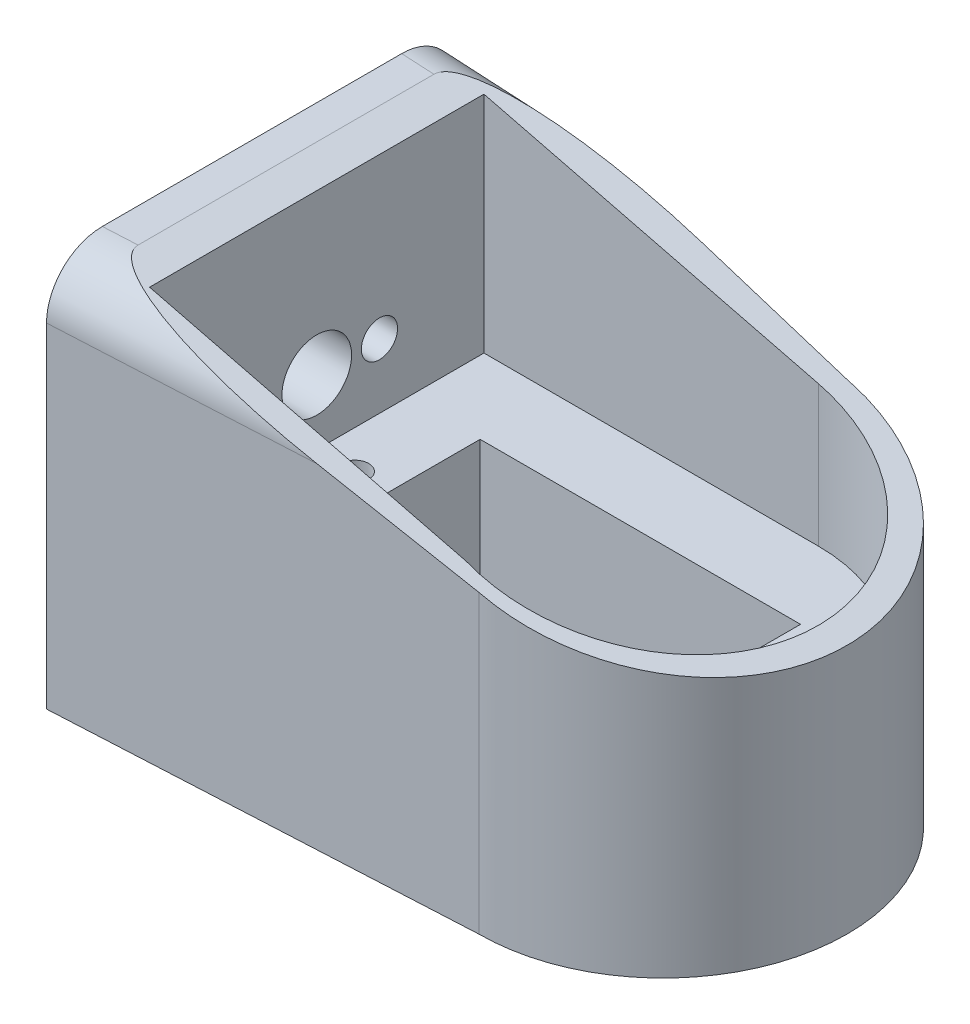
from build123d import *

# Parameters (mm, degrees)
SKETCH1_W           = 29.5
SKETCH1_H           = 28
BOSS_EXTRUDE2_DEPTH = 29.5
CUT_EXTRUDE3_DEPTH  = 29.5
BOSS_EXTRUDE4_DEPTH = 28
CUT_EXTRUDE4_DEPTH  = 16.7
SKETCH8_W           = 23
SKETCH8_H           = 13
CUT_EXTRUDE5_DEPTH  = 9
SKETCH9_R           = 1
CUT_EXTRUDE6_DEPTH  = 5
SKETCH10_R          = 6.5
CUT_EXTRUDE7_DEPTH  = 5
SKETCH11_R          = 2.5
SKETCH11_R_2        = 1.3
CUT_EXTRUDE8_DEPTH  = 5
CUT_EXTRUDE9_DEPTH  = 42
FILLET1_R           = 4


with BuildPart() as part:
    # Sketch1 → Boss-Extrude2 (new body)
    with BuildSketch(Plane.XY):
        with Locations((13.819252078, 14)):
            Rectangle(SKETCH1_W, SKETCH1_H)
    extrude(amount=BOSS_EXTRUDE2_DEPTH)

    # Sketch5 → Cut-Extrude3 (cut)
    with BuildSketch(Plane.XZ):
        Polygon((-0.930747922, 29.5), (28.569252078, 27.97), (28.569252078, 29.5), align=None)
        Polygon((28.569252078, 1.53), (-0.930747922, 0), (28.569252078, 0), align=None)
    extrude(amount=-CUT_EXTRUDE3_DEPTH, mode=Mode.SUBTRACT)

    # Sketch6 → Boss-Extrude4 (add)
    with BuildSketch(Plane.XZ):
        with BuildLine():
            Line((28.569252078, 27.97), (28.569252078, 1.53))
            ThreePointArc((28.569252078, 1.53), (41.789252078, 14.75), (28.569252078, 27.97))
        make_face()
    extrude(amount=-BOSS_EXTRUDE4_DEPTH)

    # Sketch7 → Cut-Extrude4 (cut)
    with BuildSketch(Plane(origin=(0, 28, 0), x_dir=(1, 0, 0), z_dir=(0, 1, 0))):
        with BuildLine():
            Line((3.934618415, -2.967786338), (3.934618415, -26.967786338))
            Line((3.934618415, -26.967786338), (26.639581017, -26.967786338))
            ThreePointArc((26.639581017, -26.967786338), (39.952075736, -15.651187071), (27.934618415, -2.967786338))
            Line((27.934618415, -2.967786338), (3.934618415, -2.967786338))
        make_face()
    extrude(amount=-CUT_EXTRUDE4_DEPTH, mode=Mode.SUBTRACT)

    # Sketch8 → Cut-Extrude5 (cut)
    with BuildSketch(Plane(origin=(0, 11.3, 0), x_dir=(1, 0, 0), z_dir=(0, 1, 0))):
        with Locations((20.659431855, -14.967786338)):
            Rectangle(SKETCH8_W, SKETCH8_H)
    extrude(amount=-CUT_EXTRUDE5_DEPTH, mode=Mode.SUBTRACT)

    # Sketch9 → Cut-Extrude6 (cut)
    with BuildSketch(Plane(origin=(0, 11.3, 0), x_dir=(1, 0, 0), z_dir=(0, 1, 0))):
        with Locations(Location((6.659431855, -14.967786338, 0), (0, 0, 270))):
            Circle(SKETCH9_R)
        with Locations(Location((34.659431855, -14.967786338, 0), (0, 0, 270))):
            Circle(SKETCH9_R)
    extrude(amount=-CUT_EXTRUDE6_DEPTH, mode=Mode.SUBTRACT)

    # Sketch10 → Cut-Extrude7 (cut)
    with BuildSketch(Plane(origin=(0, 2.3, 0), x_dir=(1, 0, 0), z_dir=(0, 1, 0))):
        with Locations(Location((25.159431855, -14.967786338, 0), (0, 0, 270))):
            Circle(SKETCH10_R)
    extrude(amount=-CUT_EXTRUDE7_DEPTH, mode=Mode.SUBTRACT)

    # Sketch11 → Cut-Extrude8 (cut)
    with BuildSketch(Plane(origin=(3.934618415, 0, 0), x_dir=(0, 0, -1), z_dir=(1, 0, 0))):
        with Locations((-14.967786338, 15.936634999)):
            Circle(SKETCH11_R)
        with Locations((-10.467786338, 15.936634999)):
            Circle(SKETCH11_R_2)
        with Locations((-19.467786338, 15.936634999)):
            Circle(SKETCH11_R_2)
    extrude(amount=-CUT_EXTRUDE8_DEPTH, mode=Mode.SUBTRACT)

    # Sketch13 → Cut-Extrude9 (cut)
    with BuildSketch(Plane.XY):
        with BuildLine():
            Line((1.508474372, 28), (44.413984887, 17.291570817))
            Line((44.413984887, 17.291570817), (44.828308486, 29.583170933))
            ThreePointArc((44.828308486, 29.583170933), (23.140585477, 29.552431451), (1.508474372, 28))
        make_face()
    extrude(amount=CUT_EXTRUDE9_DEPTH, mode=Mode.SUBTRACT)

    # Fillet1
    fillet1_edges = [part.edges().sort_by_distance(p)[0] for p in [
        (0.288863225, 28, 0.063254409),
        (0.288863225, 28, 29.436745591),
    ]]
    fillet(fillet1_edges, radius=FILLET1_R)


solid = part.part
